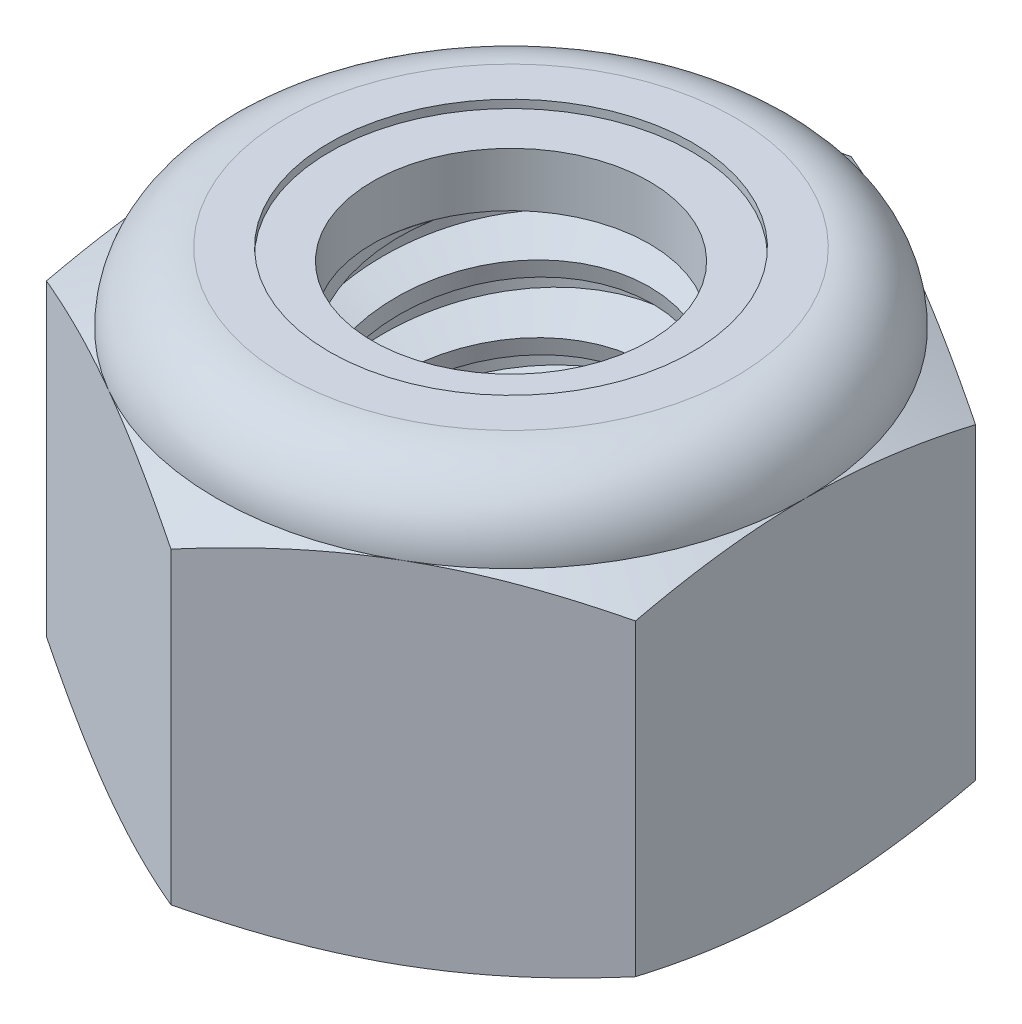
from build123d import *

# Parameters (mm, degrees)
EXTRUDE1_DEPTH      = 7.9375
SKETCH2_W           = 3.175
SKETCH2_H           = 7.9375
LPATTERN1_COUNT     = 6
LPATTERN1_PITCH     = 1.27
LPATTERN1_COL_COUNT = 2
LPATTERN1_COL_PITCH = 1.27


with BuildPart() as part:
    # Sketch1 → Extrude1 (new body)
    with BuildSketch(Plane(origin=(0, 0, 0), x_dir=(1, 0, 0), z_dir=(0, 1, 0))):
        Polygon((0, 6.415804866), (-5.55625, 3.207902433), (-5.55625, -3.207902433), (0, -6.415804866), (5.55625, -3.207902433), (5.55625, 3.207902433), align=None)
    extrude(amount=EXTRUDE1_DEPTH)

    # Sketch4 → Cut-Revolve2 (revolve, cut)
    with BuildSketch(Plane(origin=(0, 0, 0), x_dir=(0, 0, -1), z_dir=(1, 0, 0)), mode=Mode.PRIVATE) as cut_revolve2_sk:
        Polygon((0, 7.9375), (3.175, 7.9375), (2.609908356, 7.673993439), (2.609908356, 0.263506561), (3.175, 0), (0, 0), align=None)
    revolve(cut_revolve2_sk.sketch.rotate(Axis((0, 7.9375, 0), (0, 1, 0)), 54.49881281), axis=Axis((0, 7.9375, 0), (0, 1, 0)), mode=Mode.SUBTRACT)


with BuildPart() as body_2:
    # Sketch2 → Revolve1 (revolve)
    with BuildSketch(Plane(origin=(0, 0, 0), x_dir=(0, 0, -1), z_dir=(1, 0, 0))):
        with Locations((1.5875, 3.96875)):
            Rectangle(SKETCH2_W, SKETCH2_H)
    revolve(axis=Axis((0, -3.175, 0), (0, 1, 0)))

    # Sketch3 → Cut-Revolve1 (revolve, cut)
    with BuildSketch(Plane(origin=(0, 0, 0), x_dir=(0, 0, -1), z_dir=(1, 0, 0)), mode=Mode.PRIVATE) as cut_revolve1_sk:
        Polygon((3.206133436, 7.781832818), (3.424067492, 6.692162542), (2.672175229, 6.946518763), (2.609908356, 7.257853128), align=None)
    cut_revolve1 = revolve(cut_revolve1_sk.sketch.rotate(Axis((0, 7.9375, 0.272704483), (0, -0.9805806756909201, -0.1961161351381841)), 180), axis=Axis((0, 7.9375, 0.272704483), (0, -0.9805806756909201, -0.1961161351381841)), mode=Mode.SUBTRACT)

    # LPattern1: Cut-Revolve1 ×6
    with Locations(*[(0, -i * LPATTERN1_PITCH, 0) for i in range(1, LPATTERN1_COUNT)]):
        add(cut_revolve1, mode=Mode.SUBTRACT)

    # LPattern1 col: Cut-Revolve1 ×2
    with Locations(*[(0, i * LPATTERN1_COL_PITCH, 0) for i in range(1, LPATTERN1_COL_COUNT)]):
        add(cut_revolve1, mode=Mode.SUBTRACT)


with BuildPart() as part_1:
    add(part.part)

    # Combine1: cut body 2
    add(body_2.part, mode=Mode.SUBTRACT)

    # Sketch5 → Cut-Revolve3 (revolve, cut)
    with BuildSketch(Plane(origin=(0, 0, 0), x_dir=(0, 0, -1), z_dir=(1, 0, 0)), mode=Mode.PRIVATE) as cut_revolve3_sk:
        with BuildLine():
            Line((0, 0), (5.55625, 0))
            Line((5.55625, 0), (6.415804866, 0.400817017))
            Line((6.415804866, 0.400817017), (6.415804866, 6.213766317))
            Line((6.415804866, 6.213766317), (5.55625, 6.614583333))
            ThreePointArc((5.55625, 6.614583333), (5.168776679, 7.550026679), (4.233333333, 7.9375))
            Line((4.233333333, 7.9375), (4.233333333, 9.2075))
            Line((4.233333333, 9.2075), (7.685804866, 9.2075))
            Line((7.685804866, 9.2075), (7.685804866, -1.27))
            Line((7.685804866, -1.27), (0, -1.27))
            Line((0, -1.27), (0, 0))
        make_face()
    revolve(cut_revolve3_sk.sketch.rotate(Axis((0, 0, 0), (0, 1, 0)), 54.619043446), axis=Axis((0, 0, 0), (0, 1, 0)), mode=Mode.SUBTRACT)

    # Sketch6 → Cut-Revolve4 (revolve, cut)
    with BuildSketch(Plane(origin=(0, 0, 0), x_dir=(0, 0, -1), z_dir=(1, 0, 0)), mode=Mode.PRIVATE) as cut_revolve4_sk:
        with BuildLine():
            Line((0, 6.614583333), (5.40385, 6.614583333))
            ThreePointArc((5.40385, 6.614583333), (5.061013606, 7.442263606), (4.233333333, 7.7851))
            Line((4.233333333, 7.7851), (3.421620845, 7.7851))
            Line((3.421620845, 7.7851), (3.421620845, 9.2075))
            Line((3.421620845, 9.2075), (0, 9.2075))
            Line((0, 9.2075), (0, 6.614583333))
        make_face()
    revolve(cut_revolve4_sk.sketch.rotate(Axis((0, 9.2075, 0), (0, 1, 0)), 54.49881281), axis=Axis((0, 9.2075, 0), (0, 1, 0)), mode=Mode.SUBTRACT)


with BuildPart() as body_2_2:
    # Sketch7 → Revolve2 (revolve)
    with BuildSketch(Plane(origin=(0, 0, 0), x_dir=(0, 0, -1), z_dir=(1, 0, 0))):
        with BuildLine():
            Line((2.609908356, 6.690783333), (5.324993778, 6.690783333))
            ThreePointArc((5.324993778, 6.690783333), (4.979705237, 7.4148695), (4.233333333, 7.7089))
            Line((4.233333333, 7.7089), (2.609908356, 7.7089))
            Line((2.609908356, 7.7089), (2.609908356, 6.690783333))
        make_face()
    revolve(axis=Axis((0, 6.690783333, 0), (0, 1, 0)))


solid = Compound([part_1.part, body_2_2.part])
